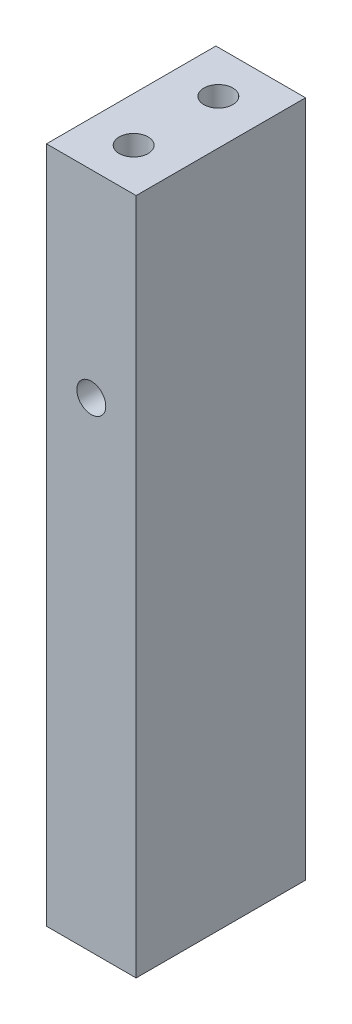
from build123d import *

# Parameters (mm, degrees)
ESBO_O1_W                   = 6.35
ESBO_O1_H                   = 48
RESSALTO_EXTRUS_O1_DEPTH    = 12
FURO_ROSCADO_DE_M2_51_D     = 2.05
FURO_ROSCADO_DE_M2_51_DEPTH = 10
FURO_ROSCADO_DE_M2_51_TIP   = 0.615882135
FURO_ROSCADO_DE_M2_53_D     = 2.05
FURO_ROSCADO_DE_M2_53_DEPTH = 9.384117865
FURO_ROSCADO_DE_M2_53_TIP   = 0.615882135
FURO_ROSCADO_DE_M2_54_D     = 2.05
FURO_ROSCADO_DE_M2_54_DEPTH = 9.384117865
FURO_ROSCADO_DE_M2_54_TIP   = 0.615882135


with BuildPart() as part:
    # Esbo_o1 → Ressalto-extrus_o1 (new body)
    with BuildSketch(Plane.XY):
        with Locations((3.175, 24)):
            Rectangle(ESBO_O1_W, ESBO_O1_H)
    extrude(amount=RESSALTO_EXTRUS_O1_DEPTH)

    # Furo roscado de M2.51
    with Locations(Plane(origin=(3.175, 0, 9), x_dir=(0, 0, -1), z_dir=(0, -1, 0))):
        with Locations((0, 0), (6, 0)):
            Hole(FURO_ROSCADO_DE_M2_51_D / 2, depth=FURO_ROSCADO_DE_M2_51_DEPTH)
            with Locations((0, 0, -(FURO_ROSCADO_DE_M2_51_DEPTH + FURO_ROSCADO_DE_M2_51_TIP / 2))):  # 118° drill point
                Cone(0, FURO_ROSCADO_DE_M2_51_D / 2, FURO_ROSCADO_DE_M2_51_TIP, mode=Mode.SUBTRACT)

    # Furo roscado de M2.53
    with Locations(Plane(origin=(3.175, 48, 3), x_dir=(0, 0, 1), z_dir=(0, 1, 0))):
        with Locations((0, 0), (6, 0)):
            Hole(FURO_ROSCADO_DE_M2_53_D / 2, depth=FURO_ROSCADO_DE_M2_53_DEPTH)
            with Locations((0, 0, -(FURO_ROSCADO_DE_M2_53_DEPTH + FURO_ROSCADO_DE_M2_53_TIP / 2))):  # 118° drill point
                Cone(0, FURO_ROSCADO_DE_M2_53_D / 2, FURO_ROSCADO_DE_M2_53_TIP, mode=Mode.SUBTRACT)

    # Furo roscado de M2.54
    with Locations(Plane(origin=(3.175, 34, 12), x_dir=(1, 0, 0), z_dir=(0, 0, 1))):
        with Locations((0, 0)):
            Hole(FURO_ROSCADO_DE_M2_54_D / 2, depth=FURO_ROSCADO_DE_M2_54_DEPTH)
            with Locations((0, 0, -(FURO_ROSCADO_DE_M2_54_DEPTH + FURO_ROSCADO_DE_M2_54_TIP / 2))):  # 118° drill point
                Cone(0, FURO_ROSCADO_DE_M2_54_D / 2, FURO_ROSCADO_DE_M2_54_TIP, mode=Mode.SUBTRACT)


solid = part.part
